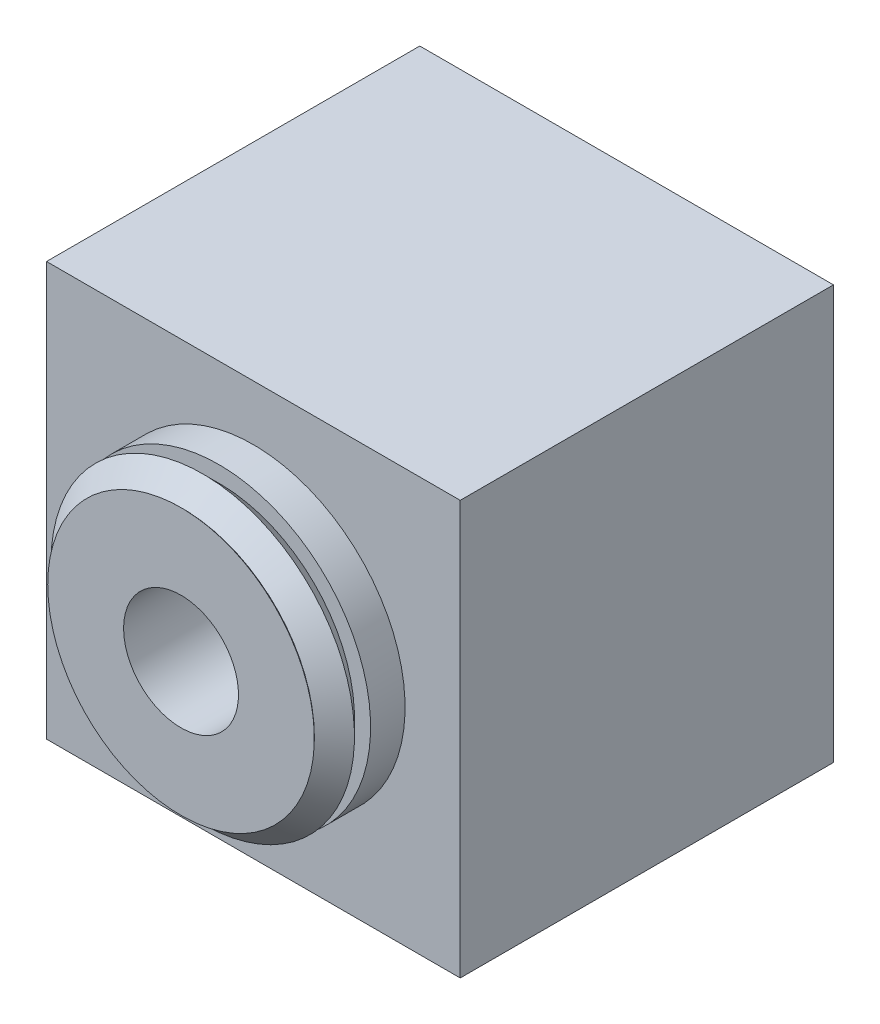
from build123d import *

# Parameters (mm, degrees)
SKETCH9_W                = 22.86
SKETCH9_H                = 22.86
F_BODY_DEPTH             = 20.6248
SKETCH11_R               = 1.7272
F_MOUNTING_HOLES_DEPTH   = 7.9248
SKETCH14_R               = 1.7272
FSR_MOUNTING_HOLES_DEPTH = 4.7498
SKETCH10_R               = 6.35
F_BODY_2_DEPTH           = 1.5748
SKETCH3_R                = 3.175
HOLE_CUT_DEPTH           = 31.783360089


with BuildPart() as part:
    # Sketch1 → Base (revolve)
    with BuildSketch(Plane(origin=(0, 0, 0), x_dir=(0, 0, -1), z_dir=(1, 0, 0)), mode=Mode.PRIVATE) as base_sk:
        Polygon((0, 0), (0, 7.366), (0.09271, 7.27329), (1.20142, 8.382), (2.093214, 7.490206), (2.093214, 8.382), (3.998214, 8.382), (3.998214, 0), align=None)
    revolve(base_sk.sketch.rotate(Axis((0, 0, -71.294124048), (0, 0, 1)), 90), axis=Axis((0, 0, -71.294124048), (0, 0, 1)))

    # Sketch9 → F Body (add)
    with BuildSketch(Plane(origin=(0, 0, -3.998214), x_dir=(-1, 0, 0), z_dir=(0, 0, -1))):
        Rectangle(SKETCH9_W, SKETCH9_H)
    extrude(amount=F_BODY_DEPTH)

    # Sketch11 → F Mounting Holes (cut)
    with BuildSketch(Plane(origin=(0, 0, -24.623014), x_dir=(-1, 0, 0), z_dir=(0, 0, -1))):
        with Locations((6.918189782, 6.5521944)):
            Circle(SKETCH11_R)
        with Locations(Location((-6.5521944, -6.918189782, 0), (0, 0, 180))):
            Circle(SKETCH11_R)
    extrude(amount=-F_MOUNTING_HOLES_DEPTH, mode=Mode.SUBTRACT)

    # Sketch14 → FSR Mounting Holes (cut)
    with BuildSketch(Plane.ZY.offset(11.43)):
        with Locations(Location((-7.173214, 5.5499, 0), (0, 0, 270))):
            Circle(SKETCH14_R)
        with Locations(Location((-18.273014, -5.5499, 0), (0, 0, 270))):
            Circle(SKETCH14_R)
    extrude(amount=-FSR_MOUNTING_HOLES_DEPTH, mode=Mode.SUBTRACT)

    # Sketch10 → F Body 2 (add)
    with BuildSketch(Plane(origin=(0, 0, -24.623014), x_dir=(-1, 0, 0), z_dir=(0, 0, -1))):
        Circle(SKETCH10_R)
    extrude(amount=F_BODY_2_DEPTH)

    # Sketch3 → Hole Cut (cut, through all)
    with BuildSketch(Plane(origin=(0, 0, 0), x_dir=(-1, 0, 0), z_dir=(0, 0, -1))):
        Circle(SKETCH3_R)
    extrude(amount=HOLE_CUT_DEPTH, mode=Mode.SUBTRACT)


solid = part.part
